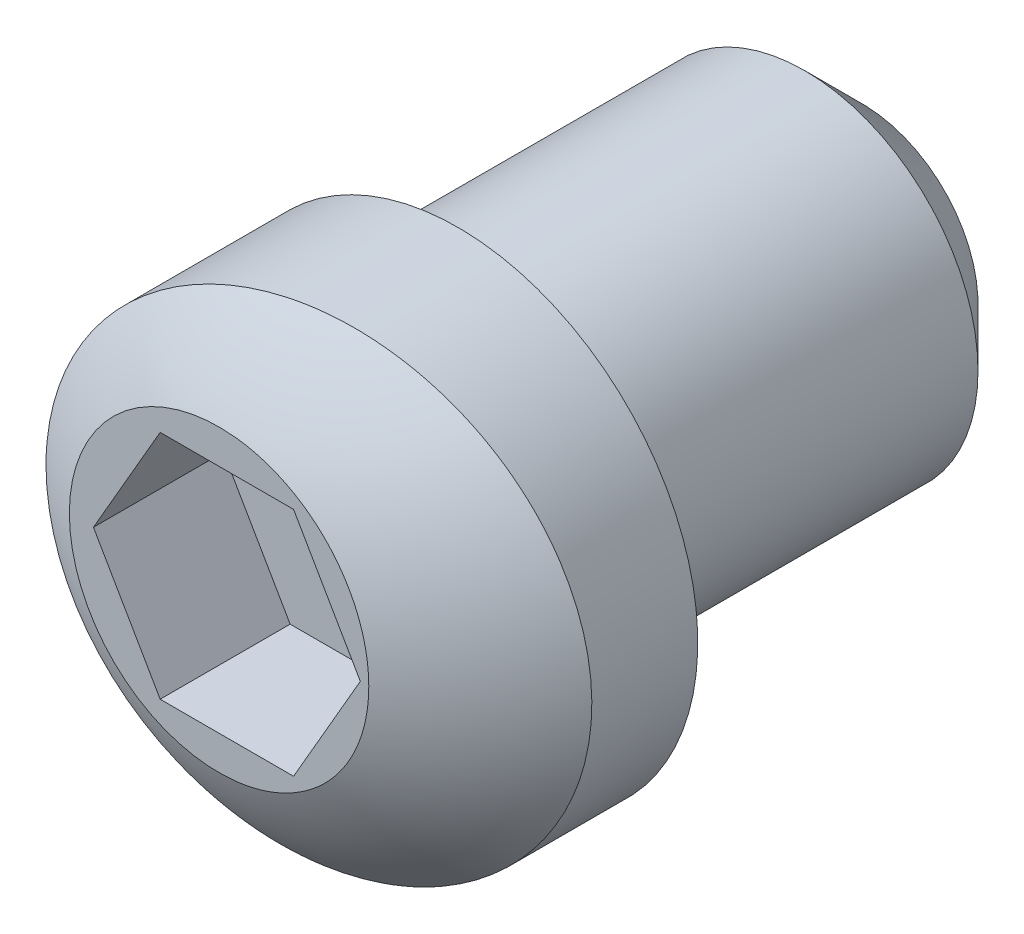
ISO-10303-21;
HEADER;
FILE_DESCRIPTION(('STEP AP214'),'2;1');
FILE_NAME('part.step','',(''),(''),'','','');
FILE_SCHEMA(('AUTOMOTIVE_DESIGN { 1 0 10303 214 1 1 1 1 }'));
ENDSEC;
DATA;
#1=APPLICATION_CONTEXT('core data for automotive mechanical design processes');
#2=APPLICATION_PROTOCOL_DEFINITION('international standard','automotive_design',2000,#1);
#3=PRODUCT_CONTEXT('',#1,'mechanical');
#4=PRODUCT('Part','Part','',(#3));
#5=PRODUCT_RELATED_PRODUCT_CATEGORY('part','',(#4));
#6=PRODUCT_DEFINITION_FORMATION('','',#4);
#7=PRODUCT_DEFINITION_CONTEXT('part definition',#1,'design');
#8=PRODUCT_DEFINITION('design','',#6,#7);
#9=PRODUCT_DEFINITION_SHAPE('','',#8);
#10=(LENGTH_UNIT() NAMED_UNIT(*) SI_UNIT(.MILLI.,.METRE.));
#11=(NAMED_UNIT(*) PLANE_ANGLE_UNIT() SI_UNIT($,.RADIAN.));
#12=(NAMED_UNIT(*) SI_UNIT($,.STERADIAN.) SOLID_ANGLE_UNIT());
#13=UNCERTAINTY_MEASURE_WITH_UNIT(LENGTH_MEASURE(1.E-05),#10,'distance_accuracy_value','');
#14=(GEOMETRIC_REPRESENTATION_CONTEXT(3) GLOBAL_UNCERTAINTY_ASSIGNED_CONTEXT((#13)) GLOBAL_UNIT_ASSIGNED_CONTEXT((#10,
#11,#12)) REPRESENTATION_CONTEXT('',''));
#15=CARTESIAN_POINT('',(0.,0.,0.));
#16=DIRECTION('',(0.,0.,1.));
#17=DIRECTION('',(1.,0.,0.));
#18=AXIS2_PLACEMENT_3D('',#15,#16,#17);
#19=CARTESIAN_POINT('',(7.12162945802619E-09,3.54403275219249E-09,-25.));
#20=DIRECTION('',(-2.84865179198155E-10,-1.417613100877E-10,1.));
#21=DIRECTION('',(1.,0.,2.84865179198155E-10));
#22=AXIS2_PLACEMENT_3D('',#19,#20,#21);
#23=CYLINDRICAL_SURFACE('',#22,6.);
#24=CARTESIAN_POINT('',(3.70324730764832E-09,1.84289703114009E-09,-13.));
#25=DIRECTION('',(2.84865179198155E-10,1.417613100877E-10,-1.));
#26=DIRECTION('',(-1.,0.,-2.84865179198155E-10));
#27=AXIS2_PLACEMENT_3D('',#24,#25,#26);
#28=CIRCLE('',#27,6.);
#29=CARTESIAN_POINT('',(-5.99999999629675,1.84289703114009E-09,-13.0000000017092));
#30=VERTEX_POINT('',#29);
#31=EDGE_CURVE('E9',#30,#30,#28,.F.);
#32=ORIENTED_EDGE('',*,*,#31,.T.);
#33=EDGE_LOOP('',(#32));
#34=FACE_BOUND('',#33,.T.);
#35=CARTESIAN_POINT('',(0.,0.,0.));
#36=DIRECTION('',(-2.84865179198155E-10,-1.417613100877E-10,1.));
#37=DIRECTION('',(1.,0.,2.84865179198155E-10));
#38=AXIS2_PLACEMENT_3D('',#35,#36,#37);
#39=CIRCLE('',#38,6.);
#40=CARTESIAN_POINT('',(6.,0.,1.70919164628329E-09));
#41=VERTEX_POINT('',#40);
#42=EDGE_CURVE('E126',#41,#41,#39,.F.);
#43=ORIENTED_EDGE('',*,*,#42,.T.);
#44=EDGE_LOOP('',(#43));
#45=FACE_BOUND('',#44,.T.);
#46=ADVANCED_FACE('F14',(#34,#45),#23,.T.);
#47=CARTESIAN_POINT('',(9.9709752,8.97097519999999,4.11212093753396E-09));
#48=DIRECTION('',(-2.84865179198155E-10,-1.417613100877E-10,1.));
#49=DIRECTION('',(-1.,0.,-2.84865179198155E-10));
#50=AXIS2_PLACEMENT_3D('',#47,#48,#49);
#51=PLANE('',#50);
#52=ORIENTED_EDGE('',*,*,#42,.F.);
#53=EDGE_LOOP('',(#52));
#54=FACE_BOUND('',#53,.T.);
#55=CARTESIAN_POINT('',(1.,0.,2.84865179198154E-10));
#56=DIRECTION('',(2.84865179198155E-10,1.417613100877E-10,-1.));
#57=DIRECTION('',(-1.,0.,-2.84865179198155E-10));
#58=AXIS2_PLACEMENT_3D('',#55,#56,#57);
#59=CIRCLE('',#58,8.3);
#60=CARTESIAN_POINT('',(-7.3,0.,-2.07951580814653E-09));
#61=VERTEX_POINT('',#60);
#62=EDGE_CURVE('E122',#61,#61,#59,.T.);
#63=ORIENTED_EDGE('',*,*,#62,.T.);
#64=EDGE_LOOP('',(#63));
#65=FACE_BOUND('',#64,.T.);
#66=ADVANCED_FACE('F143',(#54,#65),#51,.F.);
#67=CARTESIAN_POINT('',(0.999999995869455,-2.05554482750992E-09,14.5000000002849));
#68=DIRECTION('',(2.84865179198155E-10,1.417613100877E-10,-1.));
#69=DIRECTION('',(-1.,0.,-2.84865179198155E-10));
#70=AXIS2_PLACEMENT_3D('',#67,#68,#69);
#71=CYLINDRICAL_SURFACE('',#70,8.3);
#72=CARTESIAN_POINT('',(-4.85601968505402,-5.88192430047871,5.65586050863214));
#73=CARTESIAN_POINT('',(-4.68985714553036,-6.04735699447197,5.63482312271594));
#74=CARTESIAN_POINT('',(-4.51675649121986,-6.20566661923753,5.61284115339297));
#75=CARTESIAN_POINT('',(-4.15786344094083,-6.50702347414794,5.56710225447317));
#76=CARTESIAN_POINT('',(-3.9720674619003,-6.65006636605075,5.54334482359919));
#77=CARTESIAN_POINT('',(-3.58897571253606,-6.91999087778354,5.49417058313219));
#78=CARTESIAN_POINT('',(-3.39166705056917,-7.04685385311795,5.46875190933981));
#79=CARTESIAN_POINT('',(-2.9871702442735,-7.28336197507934,5.41642718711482));
#80=CARTESIAN_POINT('',(-2.77998192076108,-7.39300680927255,5.38952111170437));
#81=CARTESIAN_POINT('',(-2.35739994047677,-7.594247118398,5.33440423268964));
#82=CARTESIAN_POINT('',(-2.14201323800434,-7.6858575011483,5.30619453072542));
#83=CARTESIAN_POINT('',(-1.70440916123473,-7.8505302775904,5.24861842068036));
#84=CARTESIAN_POINT('',(-1.48219167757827,-7.92359237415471,5.2192519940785));
#85=CARTESIAN_POINT('',(-1.03260633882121,-8.0506556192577,5.15955519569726));
#86=CARTESIAN_POINT('',(-0.805240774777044,-8.10466507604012,5.12922525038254));
#87=CARTESIAN_POINT('',(-0.346790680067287,-8.19333166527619,5.06776731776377));
#88=CARTESIAN_POINT('',(-0.115704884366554,-8.2279820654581,5.0366390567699));
#89=CARTESIAN_POINT('',(0.349714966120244,-8.27781331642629,4.97362630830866));
#90=CARTESIAN_POINT('',(0.584059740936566,-8.29289011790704,4.94173868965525));
#91=CARTESIAN_POINT('',(1.05313522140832,-8.30314472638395,4.87757740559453));
#92=CARTESIAN_POINT('',(1.28786593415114,-8.29832216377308,4.84530373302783));
#93=CARTESIAN_POINT('',(1.75606496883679,-8.2688202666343,4.78058824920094));
#94=CARTESIAN_POINT('',(1.98953322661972,-8.24413993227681,4.74814642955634));
#95=CARTESIAN_POINT('',(2.45355502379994,-8.17509634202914,4.6833224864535));
#96=CARTESIAN_POINT('',(2.68410849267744,-8.13073261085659,4.6509403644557));
#97=CARTESIAN_POINT('',(3.14151986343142,-8.02242709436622,4.58635051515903));
#98=CARTESIAN_POINT('',(3.36836081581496,-7.95841305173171,4.55414388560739));
#99=CARTESIAN_POINT('',(3.81594329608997,-7.81127276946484,4.49025648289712));
#100=CARTESIAN_POINT('',(4.03668217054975,-7.72813835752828,4.45857594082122));
#101=CARTESIAN_POINT('',(4.47038193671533,-7.54334214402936,4.39600260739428));
#102=CARTESIAN_POINT('',(4.68334277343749,-7.44168021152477,4.36510982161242));
#103=CARTESIAN_POINT('',(5.09986252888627,-7.22057456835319,4.3043766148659));
#104=CARTESIAN_POINT('',(5.30342546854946,-7.1011385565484,4.27453574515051));
#105=CARTESIAN_POINT('',(5.69944342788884,-6.84548654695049,4.21619311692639));
#106=CARTESIAN_POINT('',(5.89191634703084,-6.70929876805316,4.18768921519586));
#107=CARTESIAN_POINT('',(6.26471350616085,-6.42092857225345,4.13221810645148));
#108=CARTESIAN_POINT('',(6.44503802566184,-6.26874652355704,4.10525086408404));
#109=CARTESIAN_POINT('',(6.79221464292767,-5.94944288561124,4.05309843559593));
#110=CARTESIAN_POINT('',(6.95906682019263,-5.78232138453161,4.02791323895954));
#111=CARTESIAN_POINT('',(7.2780535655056,-5.43431289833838,3.97956405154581));
#112=CARTESIAN_POINT('',(7.43018852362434,-5.25342627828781,3.95640000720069));
#113=CARTESIAN_POINT('',(7.71745258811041,-4.88065170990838,3.91249553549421));
#114=CARTESIAN_POINT('',(7.85270712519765,-4.68886251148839,3.89173732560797));
#115=CARTESIAN_POINT('',(8.10654531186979,-4.29441480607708,3.85264910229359));
#116=CARTESIAN_POINT('',(8.22513499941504,-4.09176027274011,3.83431820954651));
#117=CARTESIAN_POINT('',(8.44481382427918,-3.67693340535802,3.80026346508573));
#118=CARTESIAN_POINT('',(8.54590069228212,-3.46475984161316,3.78453995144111));
#119=CARTESIAN_POINT('',(8.7297767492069,-3.03244560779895,3.75587059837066));
#120=CARTESIAN_POINT('',(8.81256608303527,-2.81230500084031,3.74292473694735));
#121=CARTESIAN_POINT('',(8.95838314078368,-2.36815515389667,3.72008069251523));
#122=CARTESIAN_POINT('',(9.02162158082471,-2.14421674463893,3.71015003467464));
#123=CARTESIAN_POINT('',(9.1290941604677,-1.69171612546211,3.69325113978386));
#124=CARTESIAN_POINT('',(9.17332847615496,-1.46315395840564,3.68628287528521));
#125=CARTESIAN_POINT('',(9.24244994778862,-1.00306149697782,3.67538612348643));
#126=CARTESIAN_POINT('',(9.26733798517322,-0.771531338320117,3.67145749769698));
#127=CARTESIAN_POINT('',(9.29757703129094,-0.30716715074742,3.66668345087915));
#128=CARTESIAN_POINT('',(9.30292811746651,-0.0743331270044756,3.66583801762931));
#129=CARTESIAN_POINT('',(9.29408876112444,0.389030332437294,3.66723398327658));
#130=CARTESIAN_POINT('',(9.28005920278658,0.619562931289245,3.66944996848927));
#131=CARTESIAN_POINT('',(9.23284303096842,1.07868903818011,3.67690051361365));
#132=CARTESIAN_POINT('',(9.19964983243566,1.30728185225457,3.68213611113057));
#133=CARTESIAN_POINT('',(9.114362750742,1.76077834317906,3.69556794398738));
#134=CARTESIAN_POINT('',(9.06227256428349,1.98568273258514,3.70376360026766));
#135=CARTESIAN_POINT('',(8.93958419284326,2.43026340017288,3.72302712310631));
#136=CARTESIAN_POINT('',(8.86898563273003,2.64993957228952,3.73409504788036));
#137=CARTESIAN_POINT('',(8.70980059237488,3.08254851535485,3.75898697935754));
#138=CARTESIAN_POINT('',(8.6212115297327,3.29548031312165,3.77281138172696));
#139=CARTESIAN_POINT('',(8.4267099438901,3.71309010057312,3.80307154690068));
#140=CARTESIAN_POINT('',(8.32079705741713,3.91776791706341,3.81950736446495));
#141=CARTESIAN_POINT('',(8.09244773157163,4.3174233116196,3.85482055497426));
#142=CARTESIAN_POINT('',(7.97001388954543,4.51240240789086,3.8736975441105));
#143=CARTESIAN_POINT('',(7.70945640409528,4.89143151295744,3.91371607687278));
#144=CARTESIAN_POINT('',(7.5713273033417,5.07547768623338,3.93485840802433));
#145=CARTESIAN_POINT('',(7.27926416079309,5.4327239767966,3.97937491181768));
#146=CARTESIAN_POINT('',(7.12521451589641,5.60582756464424,4.00276530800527));
#147=CARTESIAN_POINT('',(6.80327578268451,5.93848355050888,4.05142631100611));
#148=CARTESIAN_POINT('',(6.63538160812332,6.09803092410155,4.07669760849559));
#149=CARTESIAN_POINT('',(6.28702737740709,6.40240834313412,4.12888116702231));
#150=CARTESIAN_POINT('',(6.10656918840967,6.54724056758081,4.15579318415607));
#151=CARTESIAN_POINT('',(5.73433479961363,6.82125256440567,4.21102875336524));
#152=CARTESIAN_POINT('',(5.54255830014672,6.95043192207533,4.23935234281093));
#153=CARTESIAN_POINT('',(5.14685061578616,7.19361909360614,4.29749464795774));
#154=CARTESIAN_POINT('',(4.94280835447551,7.30744307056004,4.32732644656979));
#155=CARTESIAN_POINT('',(4.52596796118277,7.51744749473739,4.38794702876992));
#156=CARTESIAN_POINT('',(4.31316956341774,7.61362740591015,4.41873584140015));
#157=CARTESIAN_POINT('',(3.88034849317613,7.78768208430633,4.4810225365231));
#158=CARTESIAN_POINT('',(3.66032679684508,7.86555931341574,4.51252032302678));
#159=CARTESIAN_POINT('',(3.21449944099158,8.00252403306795,4.57599990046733));
#160=CARTESIAN_POINT('',(2.98869191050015,8.06160536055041,4.60798184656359));
#161=CARTESIAN_POINT('',(2.53112542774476,8.1609372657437,4.67244037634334));
#162=CARTESIAN_POINT('',(2.29933344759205,8.20103452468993,4.7049188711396));
#163=CARTESIAN_POINT('',(1.83318436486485,8.2614187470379,4.76988516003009));
#164=CARTESIAN_POINT('',(1.59882725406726,8.28170564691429,4.80237295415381));
#165=CARTESIAN_POINT('',(1.12916347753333,8.30232370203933,4.86713719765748));
#166=CARTESIAN_POINT('',(0.893856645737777,8.30265120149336,4.89941360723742));
#167=CARTESIAN_POINT('',(0.424081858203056,8.28333059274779,4.96351993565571));
#168=CARTESIAN_POINT('',(0.189613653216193,8.26368901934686,4.99534999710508));
#169=CARTESIAN_POINT('',(-0.277401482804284,8.20449673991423,5.05843318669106));
#170=CARTESIAN_POINT('',(-0.509943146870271,8.16490296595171,5.08968491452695));
#171=CARTESIAN_POINT('',(-0.970917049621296,8.06604316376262,5.15133794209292));
#172=CARTESIAN_POINT('',(-1.19934937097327,8.00677753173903,5.1817392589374));
#173=CARTESIAN_POINT('',(-1.65046664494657,7.8689676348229,5.24150061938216));
#174=CARTESIAN_POINT('',(-1.87315152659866,7.7904231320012,5.27086065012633));
#175=CARTESIAN_POINT('',(-2.31115214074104,7.61458865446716,5.32835668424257));
#176=CARTESIAN_POINT('',(-2.52646804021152,7.51729910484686,5.35649271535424));
#177=CARTESIAN_POINT('',(-2.94738280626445,7.30503385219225,5.41126849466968));
#178=CARTESIAN_POINT('',(-3.15301471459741,7.19012500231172,5.43791339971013));
#179=CARTESIAN_POINT('',(-3.55383812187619,6.94319427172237,5.48965123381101));
#180=CARTESIAN_POINT('',(-3.74903331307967,6.81117850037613,5.51474471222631));
#181=CARTESIAN_POINT('',(-4.12765935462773,6.53089562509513,5.56324659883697));
#182=CARTESIAN_POINT('',(-4.31108826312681,6.38262584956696,5.58665472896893));
#183=CARTESIAN_POINT('',(-4.66478430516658,6.07089659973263,5.63164472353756));
#184=CARTESIAN_POINT('',(-4.83505180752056,5.90743755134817,5.65322663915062));
#185=CARTESIAN_POINT('',(-5.15996196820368,5.56773772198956,5.69428905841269));
#186=CARTESIAN_POINT('',(-5.31471020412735,5.39159964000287,5.7137838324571));
#187=CARTESIAN_POINT('',(-5.608843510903,5.02673801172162,5.75074175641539));
#188=CARTESIAN_POINT('',(-5.74822895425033,4.83801477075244,5.76820495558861));
#189=CARTESIAN_POINT('',(-6.01062243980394,4.44928884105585,5.80100491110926));
#190=CARTESIAN_POINT('',(-6.13362793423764,4.24928440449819,5.81634133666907));
#191=CARTESIAN_POINT('',(-6.3622731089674,3.83952595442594,5.84479392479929));
#192=CARTESIAN_POINT('',(-6.46791896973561,3.62977544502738,5.85791087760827));
#193=CARTESIAN_POINT('',(-6.66037484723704,3.2035787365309,5.88176816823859));
#194=CARTESIAN_POINT('',(-6.74732054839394,2.98719475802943,5.89252563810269));
#195=CARTESIAN_POINT('',(-6.90272455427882,2.54779289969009,5.91172945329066));
#196=CARTESIAN_POINT('',(-6.97118336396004,2.32477520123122,5.92017586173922));
#197=CARTESIAN_POINT('',(-7.089101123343,1.87370812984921,5.93471156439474));
#198=CARTESIAN_POINT('',(-7.13856097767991,1.64565899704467,5.94080097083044));
#199=CARTESIAN_POINT('',(-7.21811341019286,1.18616074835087,5.9505900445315));
#200=CARTESIAN_POINT('',(-7.24820637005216,0.954711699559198,5.95428975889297));
#201=CARTESIAN_POINT('',(-7.2886926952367,0.491307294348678,5.95926632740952));
#202=CARTESIAN_POINT('',(-7.2991895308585,0.259361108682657,5.96055590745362));
#203=CARTESIAN_POINT('',(-7.30071986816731,-0.204515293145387,5.96074394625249));
#204=CARTESIAN_POINT('',(-7.29176019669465,-0.43644548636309,5.95964324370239));
#205=CARTESIAN_POINT('',(-7.25445022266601,-0.898815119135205,5.95505736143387));
#206=CARTESIAN_POINT('',(-7.22609177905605,-1.129253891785,5.95157118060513));
#207=CARTESIAN_POINT('',(-7.15018759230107,-1.58689670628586,5.94223212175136));
#208=CARTESIAN_POINT('',(-7.10264215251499,-1.81410079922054,5.93637928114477));
#209=CARTESIAN_POINT('',(-6.98876521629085,-2.26347311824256,5.92234429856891));
#210=CARTESIAN_POINT('',(-6.92244960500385,-2.4856454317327,5.91416412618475));
#211=CARTESIAN_POINT('',(-6.77150796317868,-2.923577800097,5.89551666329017));
#212=CARTESIAN_POINT('',(-6.686882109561,-3.13933791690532,5.88504939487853));
#213=CARTESIAN_POINT('',(-6.50004090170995,-3.56270428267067,5.86189620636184));
#214=CARTESIAN_POINT('',(-6.39784454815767,-3.77031904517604,5.84921268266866));
#215=CARTESIAN_POINT('',(-6.17658777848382,-4.17612182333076,5.82169266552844));
#216=CARTESIAN_POINT('',(-6.05753183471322,-4.37431232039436,5.8068567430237));
#217=CARTESIAN_POINT('',(-5.77434153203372,-4.80403444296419,5.771479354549));
#218=CARTESIAN_POINT('',(-5.60612156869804,-5.03284493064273,5.75040863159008));
#219=CARTESIAN_POINT('',(-5.24731527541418,-5.47187598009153,5.70530483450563));
#220=CARTESIAN_POINT('',(-5.05672899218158,-5.68209658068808,5.68127176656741));
#221=CARTESIAN_POINT('',(-4.85601968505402,-5.88192430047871,5.65586050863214));
#222=B_SPLINE_CURVE_WITH_KNOTS('',3,(#72,#73,#74,#75,#76,#77,#78,#79,#80,#81,#82,#83,#84,#85,
#86,#87,#88,#89,#90,#91,#92,#93,#94,#95,#96,#97,#98,#99,#100,#101,#102,#103,#104,#105,#106,#107,
#108,#109,#110,#111,#112,#113,#114,#115,#116,#117,#118,#119,#120,#121,#122,#123,#124,#125,#126,
#127,#128,#129,#130,#131,#132,#133,#134,#135,#136,#137,#138,#139,#140,#141,#142,#143,#144,#145,
#146,#147,#148,#149,#150,#151,#152,#153,#154,#155,#156,#157,#158,#159,#160,#161,#162,#163,#164,
#165,#166,#167,#168,#169,#170,#171,#172,#173,#174,#175,#176,#177,#178,#179,#180,#181,#182,#183,
#184,#185,#186,#187,#188,#189,#190,#191,#192,#193,#194,#195,#196,#197,#198,#199,#200,#201,#202,
#203,#204,#205,#206,#207,#208,#209,#210,#211,#212,#213,#214,#215,#216,#217,#218,#219,#220,#221),
.UNSPECIFIED.,.T.,.F.,(4,2,2,2,2,2,2,2,2,2,2,2,2,2,2,2,2,2,2,2,2,2,2,2,2,2,2,2,2,2,2,2,2,2,2,2,
2,2,2,2,2,2,2,2,2,2,2,2,2,2,2,2,2,2,2,2,2,2,2,2,2,2,2,2,2,2,2,2,2,2,2,2,2,2,4),(0.,
0.705995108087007,1.4121903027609,2.11919204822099,2.82620662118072,3.53263427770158,
4.23907324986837,4.94520378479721,5.65157972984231,6.36169545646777,7.07182437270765,
7.78198904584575,8.49217086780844,9.20499607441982,9.91812652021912,10.6312620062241,
11.3440894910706,12.0557322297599,12.7673585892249,13.4789807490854,14.1905840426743,
14.8965374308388,15.6022343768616,16.3080227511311,17.0138055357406,17.7116925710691,
18.4095731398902,19.1074219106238,19.8052679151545,20.4973555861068,21.1896812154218,
21.8818714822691,22.5740757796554,23.2663795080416,23.9586977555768,24.6509072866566,
25.3433582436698,26.0412472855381,26.7393938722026,27.437436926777,28.1354984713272,
28.8412897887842,29.5471025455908,30.2528203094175,30.9587692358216,31.6703261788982,
32.3818854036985,33.0935749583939,33.8050316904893,34.5180307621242,35.2310154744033,
35.9440089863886,36.6569863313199,37.3673224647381,38.0774056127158,38.7876056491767,
39.4977857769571,40.2027496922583,40.9076965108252,41.6127528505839,42.3175576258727,
43.017061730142,43.7165467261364,44.4159984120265,45.1154363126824,45.8111705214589,
46.5066606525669,47.2024428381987,47.8982140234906,48.5933981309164,49.2885755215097,
49.983005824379,50.6772522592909,51.5300322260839,52.3828104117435),.UNSPECIFIED.);
#223=CARTESIAN_POINT('',(-7.30000000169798,0.,5.96065549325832));
#224=VERTEX_POINT('',#223);
#225=EDGE_CURVE('E125',#224,#224,#222,.T.);
#226=ORIENTED_EDGE('',*,*,#225,.F.);
#227=EDGE_LOOP('',(#226));
#228=FACE_BOUND('',#227,.T.);
#229=ORIENTED_EDGE('',*,*,#62,.F.);
#230=EDGE_LOOP('',(#229));
#231=FACE_BOUND('',#230,.T.);
#232=ADVANCED_FACE('F139',(#228,#231),#71,.T.);
#233=CARTESIAN_POINT('',(-0.269999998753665,0.,-4.3751608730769));
#234=DIRECTION('',(-0.147750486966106,0.,-0.989024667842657));
#235=DIRECTION('',(-0.989024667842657,0.,0.147750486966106));
#236=AXIS2_PLACEMENT_3D('',#233,#234,#235);
#237=SPHERICAL_SURFACE('',#236,12.5);
#238=CARTESIAN_POINT('',(-0.269999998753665,0.,7.00000000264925));
#239=DIRECTION('',(0.,0.,-1.));
#240=DIRECTION('',(-1.,0.,0.));
#241=AXIS2_PLACEMENT_3D('',#238,#239,#240);
#242=CIRCLE('',#241,5.18224999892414);
#243=CARTESIAN_POINT('',(-5.45224999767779,0.,7.00000000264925));
#244=VERTEX_POINT('',#243);
#245=EDGE_CURVE('E116',#244,#244,#242,.F.);
#246=CARTESIAN_POINT('',(-5.45224999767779,0.,7.00000000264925));
#247=CARTESIAN_POINT('',(-5.47237031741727,0.,6.99083366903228));
#248=CARTESIAN_POINT('',(-5.49246631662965,0.,6.98161395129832));
#249=CARTESIAN_POINT('',(-5.53260910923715,0.,6.96306800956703));
#250=CARTESIAN_POINT('',(-5.55265590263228,0.,6.9537417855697));
#251=CARTESIAN_POINT('',(-5.59269971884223,0.,6.93498309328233));
#252=CARTESIAN_POINT('',(-5.61269674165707,0.,6.92555062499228));
#253=CARTESIAN_POINT('',(-5.65264045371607,0.,6.90657970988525));
#254=CARTESIAN_POINT('',(-5.67258714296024,0.,6.89704126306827));
#255=CARTESIAN_POINT('',(-5.71242962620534,0.,6.87785865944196));
#256=CARTESIAN_POINT('',(-5.73232542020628,0.,6.86821450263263));
#257=CARTESIAN_POINT('',(-5.77206555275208,0.,6.84882075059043));
#258=CARTESIAN_POINT('',(-5.79190989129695,0.,6.83907115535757));
#259=CARTESIAN_POINT('',(-5.83154655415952,0.,6.81946680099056));
#260=CARTESIAN_POINT('',(-5.85133887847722,0.,6.80961204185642));
#261=CARTESIAN_POINT('',(-5.89087095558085,0.,6.78979763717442));
#262=CARTESIAN_POINT('',(-5.91061070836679,0.,6.77983799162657));
#263=CARTESIAN_POINT('',(-5.95003708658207,0.,6.75981409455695));
#264=CARTESIAN_POINT('',(-5.96972371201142,0.,6.74974984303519));
#265=CARTESIAN_POINT('',(-6.00904328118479,0.,6.72951701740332));
#266=CARTESIAN_POINT('',(-6.02867622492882,0.,6.71934844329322));
#267=CARTESIAN_POINT('',(-6.06788787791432,0.,6.69890725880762));
#268=CARTESIAN_POINT('',(-6.08746658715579,0.,6.68863464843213));
#269=CARTESIAN_POINT('',(-6.12656921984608,0.,6.66798568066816));
#270=CARTESIAN_POINT('',(-6.14609314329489,0.,6.65760932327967));
#271=CARTESIAN_POINT('',(-6.1850856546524,0.,6.63675315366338));
#272=CARTESIAN_POINT('',(-6.2045542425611,0.,6.62627334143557));
#273=CARTESIAN_POINT('',(-6.24343553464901,0.,6.60521055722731));
#274=CARTESIAN_POINT('',(-6.26284823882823,0.,6.59462758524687));
#275=CARTESIAN_POINT('',(-6.30161721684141,0.,6.57335877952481));
#276=CARTESIAN_POINT('',(-6.32097349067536,0.,6.56267294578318));
#277=CARTESIAN_POINT('',(-6.35962906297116,0.,6.54119871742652));
#278=CARTESIAN_POINT('',(-6.37892836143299,0.,6.53041032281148));
#279=CARTESIAN_POINT('',(-6.41746943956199,0.,6.50873127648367));
#280=CARTESIAN_POINT('',(-6.43671121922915,0.,6.49784062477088));
#281=CARTESIAN_POINT('',(-6.47513671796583,0.,6.47595737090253));
#282=CARTESIAN_POINT('',(-6.49432043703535,0.,6.46496476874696));
#283=CARTESIAN_POINT('',(-6.53262927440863,0.,6.44287792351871));
#284=CARTESIAN_POINT('',(-6.55175439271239,0.,6.43178368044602));
#285=CARTESIAN_POINT('',(-6.58994549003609,0.,6.40949386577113));
#286=CARTESIAN_POINT('',(-6.60901146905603,0.,6.39829829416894));
#287=CARTESIAN_POINT('',(-6.64708375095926,0.,6.37580613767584));
#288=CARTESIAN_POINT('',(-6.66609005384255,0.,6.36450955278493));
#289=CARTESIAN_POINT('',(-6.70404244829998,0.,6.34181568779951));
#290=CARTESIAN_POINT('',(-6.72298853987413,0.,6.33041840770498));
#291=CARTESIAN_POINT('',(-6.76081997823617,0.,6.30752347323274));
#292=CARTESIAN_POINT('',(-6.77970532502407,0.,6.29602581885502));
#293=CARTESIAN_POINT('',(-6.81741474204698,0.,6.27293045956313));
#294=CARTESIAN_POINT('',(-6.83623881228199,0.,6.26133275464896));
#295=CARTESIAN_POINT('',(-6.87382514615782,0.,6.23803762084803));
#296=CARTESIAN_POINT('',(-6.89258740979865,0.,6.22634019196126));
#297=CARTESIAN_POINT('',(-6.93004960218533,0.,6.20284593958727));
#298=CARTESIAN_POINT('',(-6.94874953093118,0.,6.19104911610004));
#299=CARTESIAN_POINT('',(-6.98608652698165,0.,6.16735640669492));
#300=CARTESIAN_POINT('',(-7.00472359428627,0.,6.15546052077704));
#301=CARTESIAN_POINT('',(-7.04193434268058,0.,6.1315700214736));
#302=CARTESIAN_POINT('',(-7.06050802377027,0.,6.11957540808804));
#303=CARTESIAN_POINT('',(-7.09759147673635,0.,6.09548779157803));
#304=CARTESIAN_POINT('',(-7.11610124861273,0.,6.08339478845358));
#305=CARTESIAN_POINT('',(-7.1530563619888,0.,6.0591107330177));
#306=CARTESIAN_POINT('',(-7.17150170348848,0.,6.04691968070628));
#307=CARTESIAN_POINT('',(-7.20832743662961,0.,6.02243987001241));
#308=CARTESIAN_POINT('',(-7.22670782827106,0.,6.01015111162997));
#309=CARTESIAN_POINT('',(-7.26340314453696,0.,5.98547623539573));
#310=CARTESIAN_POINT('',(-7.28171806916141,0.,5.97309011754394));
#311=CARTESIAN_POINT('',(-7.30000000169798,0.,5.96065549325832));
#312=B_SPLINE_CURVE_WITH_KNOTS('',3,(#246,#247,#248,#249,#250,#251,#252,#253,#254,#255,#256,
#257,#258,#259,#260,#261,#262,#263,#264,#265,#266,#267,#268,#269,#270,#271,#272,#273,#274,#275,
#276,#277,#278,#279,#280,#281,#282,#283,#284,#285,#286,#287,#288,#289,#290,#291,#292,#293,#294,
#295,#296,#297,#298,#299,#300,#301,#302,#303,#304,#305,#306,#307,#308,#309,#310,#311),
.UNSPECIFIED.,.F.,.F.,(4,2,2,2,2,2,2,2,2,2,2,2,2,2,2,2,2,2,2,2,2,2,2,2,2,2,2,2,2,2,2,2,4),(0.,
0.0663297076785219,0.132659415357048,0.19898912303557,0.265318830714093,0.331648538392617,
0.397978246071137,0.464307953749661,0.530637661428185,0.596967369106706,0.663297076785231,
0.729626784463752,0.795956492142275,0.862286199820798,0.928615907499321,0.994945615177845,
1.06127532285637,1.12760503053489,1.19393473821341,1.26026444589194,1.32659415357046,
1.39292386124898,1.45925356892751,1.52558327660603,1.59191298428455,1.65824269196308,
1.7245723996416,1.79090210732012,1.85723181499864,1.92356152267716,1.98989123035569,
2.05622093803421,2.12255064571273),.UNSPECIFIED.);
#313=EDGE_CURVE('BSEAM136',#244,#224,#312,.T.);
#314=ORIENTED_EDGE('',*,*,#245,.F.);
#315=ORIENTED_EDGE('',*,*,#225,.T.);
#316=ORIENTED_EDGE('',*,*,#313,.T.);
#317=ORIENTED_EDGE('',*,*,#313,.F.);
#318=EDGE_LOOP('',(#314,#316,#315,#317));
#319=FACE_BOUND('',#318,.T.);
#320=ADVANCED_FACE('F136',(#319),#237,.T.);
#321=CARTESIAN_POINT('',(-10.1878306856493,-12.25,7.00000000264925));
#322=DIRECTION('',(0.,0.,-1.));
#323=DIRECTION('',(-1.,0.,0.));
#324=AXIS2_PLACEMENT_3D('',#321,#322,#323);
#325=PLANE('',#324);
#326=DIRECTION('',(0.5,-0.866025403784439,0.));
#327=VECTOR('',#326,1.);
#328=CARTESIAN_POINT('',(-4.61880215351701,0.,7.00000000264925));
#329=LINE('',#328,#327);
#330=CARTESIAN_POINT('',(-4.61880215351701,0.,7.00000000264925));
#331=VERTEX_POINT('',#330);
#332=CARTESIAN_POINT('',(-2.30940107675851,-4.,7.00000000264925));
#333=VERTEX_POINT('',#332);
#334=EDGE_CURVE('E103',#331,#333,#329,.T.);
#335=ORIENTED_EDGE('',*,*,#334,.F.);
#336=DIRECTION('',(-0.5,-0.866025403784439,0.));
#337=VECTOR('',#336,1.);
#338=CARTESIAN_POINT('',(-2.30940107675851,4.,7.00000000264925));
#339=LINE('',#338,#337);
#340=CARTESIAN_POINT('',(-2.30940107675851,4.,7.00000000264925));
#341=VERTEX_POINT('',#340);
#342=EDGE_CURVE('E29',#341,#331,#339,.T.);
#343=ORIENTED_EDGE('',*,*,#342,.F.);
#344=DIRECTION('',(-1.,0.,0.));
#345=VECTOR('',#344,1.);
#346=CARTESIAN_POINT('',(2.3094010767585,4.,7.00000000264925));
#347=LINE('',#346,#345);
#348=CARTESIAN_POINT('',(2.3094010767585,4.,7.00000000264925));
#349=VERTEX_POINT('',#348);
#350=EDGE_CURVE('E112',#349,#341,#347,.T.);
#351=ORIENTED_EDGE('',*,*,#350,.F.);
#352=DIRECTION('',(-0.5,0.866025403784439,0.));
#353=VECTOR('',#352,1.);
#354=CARTESIAN_POINT('',(4.61880215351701,0.,7.00000000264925));
#355=LINE('',#354,#353);
#356=CARTESIAN_POINT('',(4.61880215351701,0.,7.00000000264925));
#357=VERTEX_POINT('',#356);
#358=EDGE_CURVE('E110',#357,#349,#355,.T.);
#359=ORIENTED_EDGE('',*,*,#358,.F.);
#360=DIRECTION('',(0.5,0.866025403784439,0.));
#361=VECTOR('',#360,1.);
#362=CARTESIAN_POINT('',(2.30940107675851,-4.,7.00000000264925));
#363=LINE('',#362,#361);
#364=CARTESIAN_POINT('',(2.30940107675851,-4.,7.00000000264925));
#365=VERTEX_POINT('',#364);
#366=EDGE_CURVE('E77',#365,#357,#363,.T.);
#367=ORIENTED_EDGE('',*,*,#366,.F.);
#368=DIRECTION('',(1.,0.,0.));
#369=VECTOR('',#368,1.);
#370=CARTESIAN_POINT('',(-2.30940107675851,-4.,7.00000000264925));
#371=LINE('',#370,#369);
#372=EDGE_CURVE('E106',#333,#365,#371,.T.);
#373=ORIENTED_EDGE('',*,*,#372,.F.);
#374=EDGE_LOOP('',(#335,#343,#351,#359,#367,#373));
#375=FACE_BOUND('',#374,.T.);
#376=ORIENTED_EDGE('',*,*,#245,.T.);
#377=EDGE_LOOP('',(#376));
#378=FACE_BOUND('',#377,.T.);
#379=ADVANCED_FACE('F145',(#375,#378),#325,.F.);
#380=CARTESIAN_POINT('',(-2.30940107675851,4.,2.50000000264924));
#381=DIRECTION('',(-0.866025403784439,0.5,0.));
#382=DIRECTION('',(-0.5,-0.866025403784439,0.));
#383=AXIS2_PLACEMENT_3D('',#380,#381,#382);
#384=PLANE('',#383);
#385=ORIENTED_EDGE('',*,*,#342,.T.);
#386=DIRECTION('',(0.,0.,1.));
#387=VECTOR('',#386,1.);
#388=CARTESIAN_POINT('',(-4.61880215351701,0.,2.50000000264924));
#389=LINE('',#388,#387);
#390=CARTESIAN_POINT('',(-4.61880215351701,0.,2.50000000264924));
#391=VERTEX_POINT('',#390);
#392=EDGE_CURVE('E59',#391,#331,#389,.T.);
#393=ORIENTED_EDGE('',*,*,#392,.F.);
#394=DIRECTION('',(-0.5,-0.866025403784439,0.));
#395=VECTOR('',#394,1.);
#396=CARTESIAN_POINT('',(-2.30940107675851,4.,2.50000000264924));
#397=LINE('',#396,#395);
#398=CARTESIAN_POINT('',(-2.30940107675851,4.,2.50000000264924));
#399=VERTEX_POINT('',#398);
#400=EDGE_CURVE('E114',#399,#391,#397,.T.);
#401=ORIENTED_EDGE('',*,*,#400,.F.);
#402=DIRECTION('',(0.,0.,1.));
#403=VECTOR('',#402,1.);
#404=CARTESIAN_POINT('',(-2.30940107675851,4.,2.50000000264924));
#405=LINE('',#404,#403);
#406=EDGE_CURVE('E37',#399,#341,#405,.T.);
#407=ORIENTED_EDGE('',*,*,#406,.T.);
#408=EDGE_LOOP('',(#385,#393,#401,#407));
#409=FACE_BOUND('',#408,.T.);
#410=ADVANCED_FACE('F148',(#409),#384,.F.);
#411=CARTESIAN_POINT('',(2.3094010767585,4.,2.50000000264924));
#412=DIRECTION('',(0.,1.,0.));
#413=DIRECTION('',(0.,0.,1.));
#414=AXIS2_PLACEMENT_3D('',#411,#412,#413);
#415=PLANE('',#414);
#416=ORIENTED_EDGE('',*,*,#350,.T.);
#417=ORIENTED_EDGE('',*,*,#406,.F.);
#418=DIRECTION('',(-1.,0.,0.));
#419=VECTOR('',#418,1.);
#420=CARTESIAN_POINT('',(2.3094010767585,4.,2.50000000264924));
#421=LINE('',#420,#419);
#422=CARTESIAN_POINT('',(2.3094010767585,4.,2.50000000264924));
#423=VERTEX_POINT('',#422);
#424=EDGE_CURVE('E89',#423,#399,#421,.T.);
#425=ORIENTED_EDGE('',*,*,#424,.F.);
#426=DIRECTION('',(0.,0.,1.));
#427=VECTOR('',#426,1.);
#428=CARTESIAN_POINT('',(2.3094010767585,4.,2.50000000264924));
#429=LINE('',#428,#427);
#430=EDGE_CURVE('E81',#423,#349,#429,.T.);
#431=ORIENTED_EDGE('',*,*,#430,.T.);
#432=EDGE_LOOP('',(#416,#417,#425,#431));
#433=FACE_BOUND('',#432,.T.);
#434=ADVANCED_FACE('F152',(#433),#415,.F.);
#435=CARTESIAN_POINT('',(4.61880215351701,0.,2.50000000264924));
#436=DIRECTION('',(0.866025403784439,0.5,0.));
#437=DIRECTION('',(-0.5,0.866025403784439,0.));
#438=AXIS2_PLACEMENT_3D('',#435,#436,#437);
#439=PLANE('',#438);
#440=ORIENTED_EDGE('',*,*,#358,.T.);
#441=ORIENTED_EDGE('',*,*,#430,.F.);
#442=DIRECTION('',(-0.5,0.866025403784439,0.));
#443=VECTOR('',#442,1.);
#444=CARTESIAN_POINT('',(4.61880215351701,0.,2.50000000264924));
#445=LINE('',#444,#443);
#446=CARTESIAN_POINT('',(4.61880215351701,0.,2.50000000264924));
#447=VERTEX_POINT('',#446);
#448=EDGE_CURVE('E85',#447,#423,#445,.T.);
#449=ORIENTED_EDGE('',*,*,#448,.F.);
#450=DIRECTION('',(0.,0.,1.));
#451=VECTOR('',#450,1.);
#452=CARTESIAN_POINT('',(4.61880215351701,0.,2.50000000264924));
#453=LINE('',#452,#451);
#454=EDGE_CURVE('E70',#447,#357,#453,.T.);
#455=ORIENTED_EDGE('',*,*,#454,.T.);
#456=EDGE_LOOP('',(#440,#441,#449,#455));
#457=FACE_BOUND('',#456,.T.);
#458=ADVANCED_FACE('F86',(#457),#439,.F.);
#459=CARTESIAN_POINT('',(2.30940107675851,-4.,2.50000000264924));
#460=DIRECTION('',(0.866025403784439,-0.5,0.));
#461=DIRECTION('',(0.5,0.866025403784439,0.));
#462=AXIS2_PLACEMENT_3D('',#459,#460,#461);
#463=PLANE('',#462);
#464=ORIENTED_EDGE('',*,*,#366,.T.);
#465=ORIENTED_EDGE('',*,*,#454,.F.);
#466=DIRECTION('',(0.5,0.866025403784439,0.));
#467=VECTOR('',#466,1.);
#468=CARTESIAN_POINT('',(2.30940107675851,-4.,2.50000000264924));
#469=LINE('',#468,#467);
#470=CARTESIAN_POINT('',(2.30940107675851,-4.,2.50000000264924));
#471=VERTEX_POINT('',#470);
#472=EDGE_CURVE('E74',#471,#447,#469,.T.);
#473=ORIENTED_EDGE('',*,*,#472,.F.);
#474=DIRECTION('',(0.,0.,1.));
#475=VECTOR('',#474,1.);
#476=CARTESIAN_POINT('',(2.30940107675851,-4.,2.50000000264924));
#477=LINE('',#476,#475);
#478=EDGE_CURVE('E82',#471,#365,#477,.T.);
#479=ORIENTED_EDGE('',*,*,#478,.T.);
#480=EDGE_LOOP('',(#464,#465,#473,#479));
#481=FACE_BOUND('',#480,.T.);
#482=ADVANCED_FACE('F72',(#481),#463,.F.);
#483=CARTESIAN_POINT('',(-2.30940107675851,-4.,2.50000000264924));
#484=DIRECTION('',(0.,-1.,0.));
#485=DIRECTION('',(1.,0.,0.));
#486=AXIS2_PLACEMENT_3D('',#483,#484,#485);
#487=PLANE('',#486);
#488=ORIENTED_EDGE('',*,*,#372,.T.);
#489=ORIENTED_EDGE('',*,*,#478,.F.);
#490=DIRECTION('',(1.,0.,0.));
#491=VECTOR('',#490,1.);
#492=CARTESIAN_POINT('',(-2.30940107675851,-4.,2.50000000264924));
#493=LINE('',#492,#491);
#494=CARTESIAN_POINT('',(-2.30940107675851,-4.,2.50000000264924));
#495=VERTEX_POINT('',#494);
#496=EDGE_CURVE('E95',#495,#471,#493,.T.);
#497=ORIENTED_EDGE('',*,*,#496,.F.);
#498=DIRECTION('',(0.,0.,1.));
#499=VECTOR('',#498,1.);
#500=CARTESIAN_POINT('',(-2.30940107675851,-4.,2.50000000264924));
#501=LINE('',#500,#499);
#502=EDGE_CURVE('E119',#495,#333,#501,.T.);
#503=ORIENTED_EDGE('',*,*,#502,.T.);
#504=EDGE_LOOP('',(#488,#489,#497,#503));
#505=FACE_BOUND('',#504,.T.);
#506=ADVANCED_FACE('F156',(#505),#487,.F.);
#507=CARTESIAN_POINT('',(-4.61880215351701,0.,2.50000000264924));
#508=DIRECTION('',(-0.866025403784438,-0.5,0.));
#509=DIRECTION('',(0.5,-0.866025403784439,0.));
#510=AXIS2_PLACEMENT_3D('',#507,#508,#509);
#511=PLANE('',#510);
#512=ORIENTED_EDGE('',*,*,#334,.T.);
#513=ORIENTED_EDGE('',*,*,#502,.F.);
#514=DIRECTION('',(0.5,-0.866025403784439,0.));
#515=VECTOR('',#514,1.);
#516=CARTESIAN_POINT('',(-4.61880215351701,0.,2.50000000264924));
#517=LINE('',#516,#515);
#518=EDGE_CURVE('E97',#391,#495,#517,.T.);
#519=ORIENTED_EDGE('',*,*,#518,.F.);
#520=ORIENTED_EDGE('',*,*,#392,.T.);
#521=EDGE_LOOP('',(#512,#513,#519,#520));
#522=FACE_BOUND('',#521,.T.);
#523=ADVANCED_FACE('F153',(#522),#511,.F.);
#524=CARTESIAN_POINT('',(0.,0.,2.50000000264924));
#525=DIRECTION('',(0.,0.,1.));
#526=DIRECTION('',(1.,0.,0.));
#527=AXIS2_PLACEMENT_3D('',#524,#525,#526);
#528=PLANE('',#527);
#529=ORIENTED_EDGE('',*,*,#400,.T.);
#530=ORIENTED_EDGE('',*,*,#518,.T.);
#531=ORIENTED_EDGE('',*,*,#496,.T.);
#532=ORIENTED_EDGE('',*,*,#472,.T.);
#533=ORIENTED_EDGE('',*,*,#448,.T.);
#534=ORIENTED_EDGE('',*,*,#424,.T.);
#535=EDGE_LOOP('',(#529,#530,#531,#532,#533,#534));
#536=FACE_BOUND('',#535,.T.);
#537=ADVANCED_FACE('F92',(#536),#528,.T.);
#538=CARTESIAN_POINT('',(4.27297767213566E-09,2.1264196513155E-09,-15.));
#539=DIRECTION('',(2.84865179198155E-10,1.417613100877E-10,-1.));
#540=DIRECTION('',(-1.,0.,-2.84865179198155E-10));
#541=AXIS2_PLACEMENT_3D('',#538,#539,#540);
#542=PLANE('',#541);
#543=CARTESIAN_POINT('',(4.27297766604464E-09,2.1264196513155E-09,-15.));
#544=DIRECTION('',(2.84865179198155E-10,1.417613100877E-10,-1.));
#545=DIRECTION('',(-1.,0.,-2.84865179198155E-10));
#546=AXIS2_PLACEMENT_3D('',#543,#544,#545);
#547=CIRCLE('',#546,4.);
#548=CARTESIAN_POINT('',(-3.99999999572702,2.1264196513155E-09,-15.0000000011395));
#549=VERTEX_POINT('',#548);
#550=EDGE_CURVE('E22',#549,#549,#547,.T.);
#551=ORIENTED_EDGE('',*,*,#550,.T.);
#552=EDGE_LOOP('',(#551));
#553=FACE_BOUND('',#552,.T.);
#554=ADVANCED_FACE('F169',(#553),#542,.T.);
#555=CARTESIAN_POINT('',(4.27297766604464E-09,2.1264196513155E-09,-15.));
#556=DIRECTION('',(-2.84865179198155E-10,-1.417613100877E-10,1.));
#557=DIRECTION('',(1.,0.,2.84865179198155E-10));
#558=AXIS2_PLACEMENT_3D('',#555,#556,#557);
#559=CONICAL_SURFACE('',#558,4.,0.785398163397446);
#560=ORIENTED_EDGE('',*,*,#31,.F.);
#561=EDGE_LOOP('',(#560));
#562=FACE_BOUND('',#561,.T.);
#563=ORIENTED_EDGE('',*,*,#550,.F.);
#564=EDGE_LOOP('',(#563));
#565=FACE_BOUND('',#564,.T.);
#566=ADVANCED_FACE('F16',(#562,#565),#559,.T.);
#567=CLOSED_SHELL('',(#46,#66,#232,#320,#379,#410,#434,#458,#482,#506,#523,#537,#554,#566));
#568=MANIFOLD_SOLID_BREP('B1',#567);
#569=ADVANCED_BREP_SHAPE_REPRESENTATION('',(#18,#568),#14);
#570=SHAPE_DEFINITION_REPRESENTATION(#9,#569);
ENDSEC;
END-ISO-10303-21;
